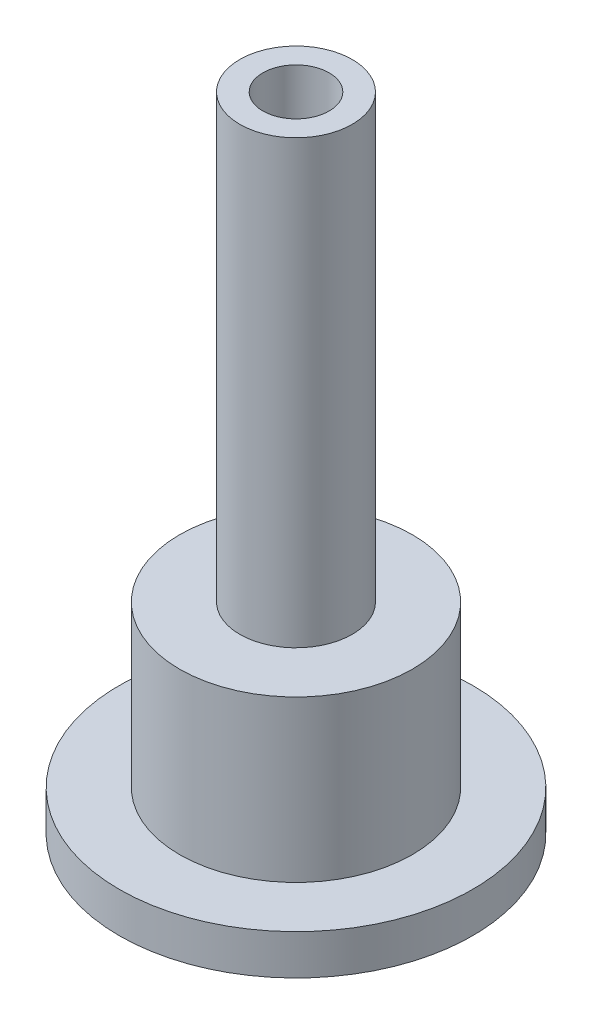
ISO-10303-21;
HEADER;
FILE_DESCRIPTION(('STEP AP214'),'2;1');
FILE_NAME('part.step','',(''),(''),'','','');
FILE_SCHEMA(('AUTOMOTIVE_DESIGN { 1 0 10303 214 1 1 1 1 }'));
ENDSEC;
DATA;
#1=APPLICATION_CONTEXT('core data for automotive mechanical design processes');
#2=APPLICATION_PROTOCOL_DEFINITION('international standard','automotive_design',2000,#1);
#3=PRODUCT_CONTEXT('',#1,'mechanical');
#4=PRODUCT('Part','Part','',(#3));
#5=PRODUCT_RELATED_PRODUCT_CATEGORY('part','',(#4));
#6=PRODUCT_DEFINITION_FORMATION('','',#4);
#7=PRODUCT_DEFINITION_CONTEXT('part definition',#1,'design');
#8=PRODUCT_DEFINITION('design','',#6,#7);
#9=PRODUCT_DEFINITION_SHAPE('','',#8);
#10=(LENGTH_UNIT() NAMED_UNIT(*) SI_UNIT(.MILLI.,.METRE.));
#11=(NAMED_UNIT(*) PLANE_ANGLE_UNIT() SI_UNIT($,.RADIAN.));
#12=(NAMED_UNIT(*) SI_UNIT($,.STERADIAN.) SOLID_ANGLE_UNIT());
#13=UNCERTAINTY_MEASURE_WITH_UNIT(LENGTH_MEASURE(1.E-05),#10,'distance_accuracy_value','');
#14=(GEOMETRIC_REPRESENTATION_CONTEXT(3) GLOBAL_UNCERTAINTY_ASSIGNED_CONTEXT((#13)) GLOBAL_UNIT_ASSIGNED_CONTEXT((#10,
#11,#12)) REPRESENTATION_CONTEXT('',''));
#15=CARTESIAN_POINT('',(0.,0.,0.));
#16=DIRECTION('',(0.,0.,1.));
#17=DIRECTION('',(1.,0.,0.));
#18=AXIS2_PLACEMENT_3D('',#15,#16,#17);
#19=CARTESIAN_POINT('',(-27.97508868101,-46.,-27.97508868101));
#20=DIRECTION('',(0.,1.,0.));
#21=DIRECTION('',(0.,0.,-1.));
#22=AXIS2_PLACEMENT_3D('',#19,#20,#21);
#23=PLANE('',#22);
#24=CARTESIAN_POINT('',(-27.97508868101,-46.,-27.97508868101));
#25=DIRECTION('',(0.,1.,0.));
#26=DIRECTION('',(0.,0.,1.));
#27=AXIS2_PLACEMENT_3D('',#24,#25,#26);
#28=CIRCLE('',#27,1.65);
#29=CARTESIAN_POINT('',(-27.97508868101,-46.,-26.32508868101));
#30=VERTEX_POINT('',#29);
#31=EDGE_CURVE('E10',#30,#30,#28,.T.);
#32=ORIENTED_EDGE('',*,*,#31,.F.);
#33=EDGE_LOOP('',(#32));
#34=FACE_BOUND('',#33,.T.);
#35=CARTESIAN_POINT('',(-27.97508868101,-46.,-27.97508868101));
#36=DIRECTION('',(0.,1.,0.));
#37=DIRECTION('',(0.,0.,1.));
#38=AXIS2_PLACEMENT_3D('',#35,#36,#37);
#39=CIRCLE('',#38,2.8);
#40=CARTESIAN_POINT('',(-27.97508868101,-46.,-25.17508868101));
#41=VERTEX_POINT('',#40);
#42=EDGE_CURVE('E128',#41,#41,#39,.T.);
#43=ORIENTED_EDGE('',*,*,#42,.T.);
#44=EDGE_LOOP('',(#43));
#45=FACE_BOUND('',#44,.T.);
#46=ADVANCED_FACE('F16',(#34,#45),#23,.T.);
#47=CARTESIAN_POINT('',(-27.97508868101,-68.01,-27.97508868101));
#48=DIRECTION('',(0.,1.,0.));
#49=DIRECTION('',(0.,0.,1.));
#50=AXIS2_PLACEMENT_3D('',#47,#48,#49);
#51=CYLINDRICAL_SURFACE('',#50,1.65);
#52=DIRECTION('',(0.,1.,0.));
#53=VECTOR('',#52,1.);
#54=CARTESIAN_POINT('',(-27.97508868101,-70.5,-26.32508868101));
#55=LINE('',#54,#53);
#56=CARTESIAN_POINT('',(-27.97508868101,-70.5,-26.32508868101));
#57=VERTEX_POINT('',#56);
#58=EDGE_CURVE('E27',#57,#30,#55,.T.);
#59=ORIENTED_EDGE('',*,*,#58,.F.);
#60=CARTESIAN_POINT('',(-27.97508868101,-70.5,-27.97508868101));
#61=DIRECTION('',(0.,1.,0.));
#62=DIRECTION('',(0.,0.,1.));
#63=AXIS2_PLACEMENT_3D('',#60,#61,#62);
#64=CIRCLE('',#63,1.65);
#65=EDGE_CURVE('E103',#57,#57,#64,.T.);
#66=ORIENTED_EDGE('',*,*,#65,.F.);
#67=ORIENTED_EDGE('',*,*,#58,.T.);
#68=ORIENTED_EDGE('',*,*,#31,.T.);
#69=EDGE_LOOP('',(#59,#66,#67,#68));
#70=FACE_BOUND('',#69,.T.);
#71=ADVANCED_FACE('F200',(#70),#51,.F.);
#72=CARTESIAN_POINT('',(-27.97508868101,-70.5,-27.97508868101));
#73=DIRECTION('',(0.,1.,0.));
#74=DIRECTION('',(0.,0.,-1.));
#75=AXIS2_PLACEMENT_3D('',#72,#73,#74);
#76=PLANE('',#75);
#77=ORIENTED_EDGE('',*,*,#65,.T.);
#78=EDGE_LOOP('',(#77));
#79=FACE_BOUND('',#78,.T.);
#80=CARTESIAN_POINT('',(-27.97508868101,-70.5,-27.97508868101));
#81=DIRECTION('',(0.,1.,0.));
#82=DIRECTION('',(0.,0.,1.));
#83=AXIS2_PLACEMENT_3D('',#80,#81,#82);
#84=CIRCLE('',#83,4.);
#85=CARTESIAN_POINT('',(-27.97508868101,-70.5,-23.97508868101));
#86=VERTEX_POINT('',#85);
#87=EDGE_CURVE('E87',#86,#86,#84,.T.);
#88=ORIENTED_EDGE('',*,*,#87,.F.);
#89=EDGE_LOOP('',(#88));
#90=FACE_BOUND('',#89,.T.);
#91=ADVANCED_FACE('F169',(#79,#90),#76,.F.);
#92=CARTESIAN_POINT('',(-27.97508868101,-78.01,-27.97508868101));
#93=DIRECTION('',(0.,1.,0.));
#94=DIRECTION('',(0.,0.,1.));
#95=AXIS2_PLACEMENT_3D('',#92,#93,#94);
#96=CYLINDRICAL_SURFACE('',#95,4.);
#97=DIRECTION('',(0.,1.,0.));
#98=VECTOR('',#97,1.);
#99=CARTESIAN_POINT('',(-27.97508868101,-78.,-23.97508868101));
#100=LINE('',#99,#98);
#101=CARTESIAN_POINT('',(-27.97508868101,-78.,-23.97508868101));
#102=VERTEX_POINT('',#101);
#103=EDGE_CURVE('E82',#102,#86,#100,.T.);
#104=ORIENTED_EDGE('',*,*,#103,.F.);
#105=CARTESIAN_POINT('',(-27.97508868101,-78.,-27.97508868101));
#106=DIRECTION('',(0.,1.,0.));
#107=DIRECTION('',(0.,0.,1.));
#108=AXIS2_PLACEMENT_3D('',#105,#106,#107);
#109=CIRCLE('',#108,4.);
#110=EDGE_CURVE('E85',#102,#102,#109,.T.);
#111=ORIENTED_EDGE('',*,*,#110,.F.);
#112=ORIENTED_EDGE('',*,*,#103,.T.);
#113=ORIENTED_EDGE('',*,*,#87,.T.);
#114=EDGE_LOOP('',(#104,#111,#112,#113));
#115=FACE_BOUND('',#114,.T.);
#116=ADVANCED_FACE('F84',(#115),#96,.F.);
#117=CARTESIAN_POINT('',(-27.97508868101,-78.,-27.97508868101));
#118=DIRECTION('',(0.,1.,0.));
#119=DIRECTION('',(0.,0.,-1.));
#120=AXIS2_PLACEMENT_3D('',#117,#118,#119);
#121=PLANE('',#120);
#122=ORIENTED_EDGE('',*,*,#110,.T.);
#123=EDGE_LOOP('',(#122));
#124=FACE_BOUND('',#123,.T.);
#125=CARTESIAN_POINT('',(-27.97508868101,-78.,-27.97508868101));
#126=DIRECTION('',(0.,1.,0.));
#127=DIRECTION('',(0.,0.,1.));
#128=AXIS2_PLACEMENT_3D('',#125,#126,#127);
#129=CIRCLE('',#128,8.8);
#130=CARTESIAN_POINT('',(-27.97508868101,-78.,-19.17508868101));
#131=VERTEX_POINT('',#130);
#132=EDGE_CURVE('E93',#131,#131,#129,.T.);
#133=ORIENTED_EDGE('',*,*,#132,.F.);
#134=EDGE_LOOP('',(#133));
#135=FACE_BOUND('',#134,.T.);
#136=ADVANCED_FACE('F18',(#124,#135),#121,.F.);
#137=CARTESIAN_POINT('',(-27.97508868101,-78.,-27.97508868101));
#138=DIRECTION('',(0.,1.,0.));
#139=DIRECTION('',(0.,0.,1.));
#140=AXIS2_PLACEMENT_3D('',#137,#138,#139);
#141=CYLINDRICAL_SURFACE('',#140,8.8);
#142=CARTESIAN_POINT('',(-27.97508868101,-76.,-27.97508868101));
#143=DIRECTION('',(0.,1.,0.));
#144=DIRECTION('',(0.,0.,1.));
#145=AXIS2_PLACEMENT_3D('',#142,#143,#144);
#146=CIRCLE('',#145,8.8);
#147=CARTESIAN_POINT('',(-27.97508868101,-76.,-19.17508868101));
#148=VERTEX_POINT('',#147);
#149=EDGE_CURVE('E139',#148,#148,#146,.T.);
#150=ORIENTED_EDGE('',*,*,#149,.F.);
#151=DIRECTION('',(0.,1.,0.));
#152=VECTOR('',#151,1.);
#153=CARTESIAN_POINT('',(-27.97508868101,-78.,-19.17508868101));
#154=LINE('',#153,#152);
#155=EDGE_CURVE('E20',#131,#148,#154,.T.);
#156=ORIENTED_EDGE('',*,*,#155,.F.);
#157=ORIENTED_EDGE('',*,*,#132,.T.);
#158=ORIENTED_EDGE('',*,*,#155,.T.);
#159=EDGE_LOOP('',(#150,#156,#157,#158));
#160=FACE_BOUND('',#159,.T.);
#161=ADVANCED_FACE('F189',(#160),#141,.T.);
#162=CARTESIAN_POINT('',(-27.97508868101,-76.,-27.97508868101));
#163=DIRECTION('',(0.,1.,0.));
#164=DIRECTION('',(0.,0.,-1.));
#165=AXIS2_PLACEMENT_3D('',#162,#163,#164);
#166=PLANE('',#165);
#167=CARTESIAN_POINT('',(-27.97508868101,-76.,-27.97508868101));
#168=DIRECTION('',(0.,1.,0.));
#169=DIRECTION('',(0.,0.,1.));
#170=AXIS2_PLACEMENT_3D('',#167,#168,#169);
#171=CIRCLE('',#170,5.8);
#172=CARTESIAN_POINT('',(-27.97508868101,-76.,-22.17508868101));
#173=VERTEX_POINT('',#172);
#174=EDGE_CURVE('E66',#173,#173,#171,.T.);
#175=ORIENTED_EDGE('',*,*,#174,.F.);
#176=EDGE_LOOP('',(#175));
#177=FACE_BOUND('',#176,.T.);
#178=ORIENTED_EDGE('',*,*,#149,.T.);
#179=EDGE_LOOP('',(#178));
#180=FACE_BOUND('',#179,.T.);
#181=ADVANCED_FACE('F157',(#177,#180),#166,.T.);
#182=CARTESIAN_POINT('',(-27.97508868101,-70.5,-27.97508868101));
#183=DIRECTION('',(0.,1.,0.));
#184=DIRECTION('',(0.,0.,1.));
#185=AXIS2_PLACEMENT_3D('',#182,#183,#184);
#186=CYLINDRICAL_SURFACE('',#185,5.8);
#187=CARTESIAN_POINT('',(-27.97508868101,-68.,-27.97508868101));
#188=DIRECTION('',(0.,1.,0.));
#189=DIRECTION('',(0.,0.,1.));
#190=AXIS2_PLACEMENT_3D('',#187,#188,#189);
#191=CIRCLE('',#190,5.8);
#192=CARTESIAN_POINT('',(-27.97508868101,-68.,-22.17508868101));
#193=VERTEX_POINT('',#192);
#194=EDGE_CURVE('E116',#193,#193,#191,.T.);
#195=ORIENTED_EDGE('',*,*,#194,.F.);
#196=DIRECTION('',(0.,-1.,0.));
#197=VECTOR('',#196,1.);
#198=CARTESIAN_POINT('',(-27.97508868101,-68.,-22.17508868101));
#199=LINE('',#198,#197);
#200=EDGE_CURVE('E119',#193,#173,#199,.T.);
#201=ORIENTED_EDGE('',*,*,#200,.T.);
#202=ORIENTED_EDGE('',*,*,#174,.T.);
#203=ORIENTED_EDGE('',*,*,#200,.F.);
#204=EDGE_LOOP('',(#195,#201,#202,#203));
#205=FACE_BOUND('',#204,.T.);
#206=ADVANCED_FACE('F151',(#205),#186,.T.);
#207=CARTESIAN_POINT('',(-27.97508868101,-68.,-27.97508868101));
#208=DIRECTION('',(0.,1.,0.));
#209=DIRECTION('',(0.,0.,-1.));
#210=AXIS2_PLACEMENT_3D('',#207,#208,#209);
#211=PLANE('',#210);
#212=CARTESIAN_POINT('',(-27.97508868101,-68.,-27.97508868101));
#213=DIRECTION('',(0.,1.,0.));
#214=DIRECTION('',(0.,0.,1.));
#215=AXIS2_PLACEMENT_3D('',#212,#213,#214);
#216=CIRCLE('',#215,2.8);
#217=CARTESIAN_POINT('',(-27.97508868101,-68.,-25.17508868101));
#218=VERTEX_POINT('',#217);
#219=EDGE_CURVE('E120',#218,#218,#216,.T.);
#220=ORIENTED_EDGE('',*,*,#219,.F.);
#221=EDGE_LOOP('',(#220));
#222=FACE_BOUND('',#221,.T.);
#223=ORIENTED_EDGE('',*,*,#194,.T.);
#224=EDGE_LOOP('',(#223));
#225=FACE_BOUND('',#224,.T.);
#226=ADVANCED_FACE('F156',(#222,#225),#211,.T.);
#227=CARTESIAN_POINT('',(-27.97508868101,-68.,-27.97508868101));
#228=DIRECTION('',(0.,1.,0.));
#229=DIRECTION('',(0.,0.,1.));
#230=AXIS2_PLACEMENT_3D('',#227,#228,#229);
#231=CYLINDRICAL_SURFACE('',#230,2.8);
#232=ORIENTED_EDGE('',*,*,#42,.F.);
#233=DIRECTION('',(0.,1.,0.));
#234=VECTOR('',#233,1.);
#235=CARTESIAN_POINT('',(-27.97508868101,-68.,-25.17508868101));
#236=LINE('',#235,#234);
#237=EDGE_CURVE('E102',#218,#41,#236,.T.);
#238=ORIENTED_EDGE('',*,*,#237,.F.);
#239=ORIENTED_EDGE('',*,*,#219,.T.);
#240=ORIENTED_EDGE('',*,*,#237,.T.);
#241=EDGE_LOOP('',(#232,#238,#239,#240));
#242=FACE_BOUND('',#241,.T.);
#243=ADVANCED_FACE('F179',(#242),#231,.T.);
#244=CLOSED_SHELL('',(#46,#71,#91,#116,#136,#161,#181,#206,#226,#243));
#245=MANIFOLD_SOLID_BREP('B1',#244);
#246=ADVANCED_BREP_SHAPE_REPRESENTATION('',(#18,#245),#14);
#247=SHAPE_DEFINITION_REPRESENTATION(#9,#246);
ENDSEC;
END-ISO-10303-21;
